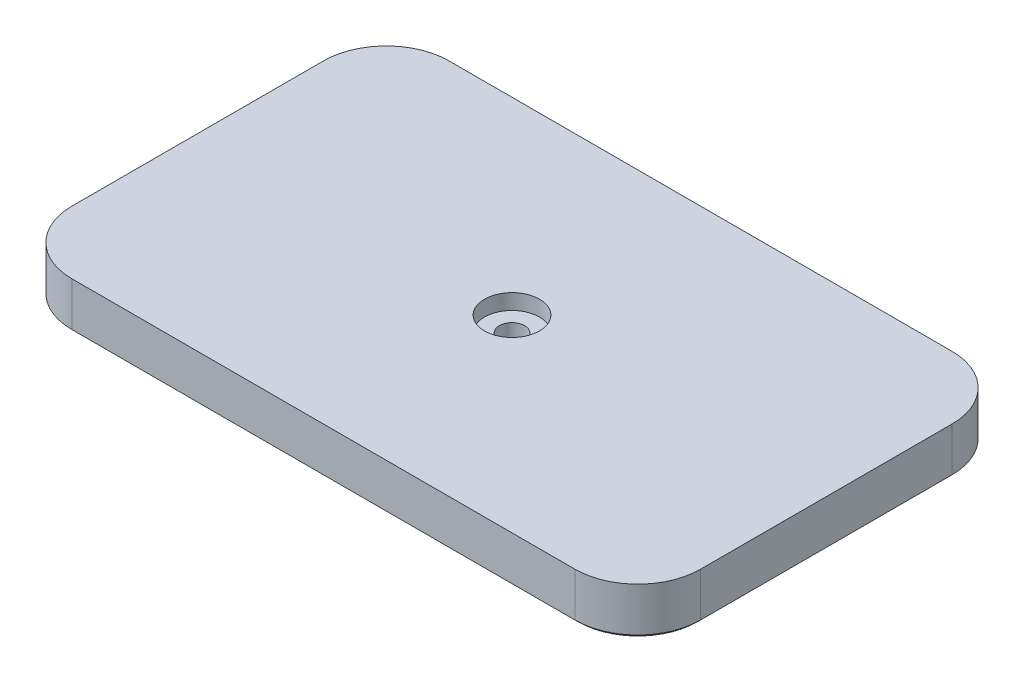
ISO-10303-21;
HEADER;
FILE_DESCRIPTION(('STEP AP214'),'2;1');
FILE_NAME('part.step','',(''),(''),'','','');
FILE_SCHEMA(('AUTOMOTIVE_DESIGN { 1 0 10303 214 1 1 1 1 }'));
ENDSEC;
DATA;
#1=APPLICATION_CONTEXT('core data for automotive mechanical design processes');
#2=APPLICATION_PROTOCOL_DEFINITION('international standard','automotive_design',2000,#1);
#3=PRODUCT_CONTEXT('',#1,'mechanical');
#4=PRODUCT('Part','Part','',(#3));
#5=PRODUCT_RELATED_PRODUCT_CATEGORY('part','',(#4));
#6=PRODUCT_DEFINITION_FORMATION('','',#4);
#7=PRODUCT_DEFINITION_CONTEXT('part definition',#1,'design');
#8=PRODUCT_DEFINITION('design','',#6,#7);
#9=PRODUCT_DEFINITION_SHAPE('','',#8);
#10=(LENGTH_UNIT() NAMED_UNIT(*) SI_UNIT(.MILLI.,.METRE.));
#11=(NAMED_UNIT(*) PLANE_ANGLE_UNIT() SI_UNIT($,.RADIAN.));
#12=(NAMED_UNIT(*) SI_UNIT($,.STERADIAN.) SOLID_ANGLE_UNIT());
#13=UNCERTAINTY_MEASURE_WITH_UNIT(LENGTH_MEASURE(1.E-05),#10,'distance_accuracy_value','');
#14=(GEOMETRIC_REPRESENTATION_CONTEXT(3) GLOBAL_UNCERTAINTY_ASSIGNED_CONTEXT((#13)) GLOBAL_UNIT_ASSIGNED_CONTEXT((#10,
#11,#12)) REPRESENTATION_CONTEXT('',''));
#15=CARTESIAN_POINT('',(0.,0.,0.));
#16=DIRECTION('',(0.,0.,1.));
#17=DIRECTION('',(1.,0.,0.));
#18=AXIS2_PLACEMENT_3D('',#15,#16,#17);
#19=CARTESIAN_POINT('',(-63.5,9.525,-38.1));
#20=DIRECTION('',(1.,0.,0.));
#21=DIRECTION('',(0.,0.,-1.));
#22=AXIS2_PLACEMENT_3D('',#19,#20,#21);
#23=PLANE('',#22);
#24=DIRECTION('',(0.,-1.,0.));
#25=VECTOR('',#24,1.);
#26=CARTESIAN_POINT('',(-63.5,9.525,-25.4));
#27=LINE('',#26,#25);
#28=CARTESIAN_POINT('',(-63.5,9.525,-25.4));
#29=VERTEX_POINT('',#28);
#30=CARTESIAN_POINT('',(-63.5,0.634999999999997,-25.4));
#31=VERTEX_POINT('',#30);
#32=EDGE_CURVE('E134',#29,#31,#27,.T.);
#33=ORIENTED_EDGE('',*,*,#32,.T.);
#34=DIRECTION('',(0.,0.,1.));
#35=VECTOR('',#34,1.);
#36=CARTESIAN_POINT('',(-63.5,0.634999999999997,-38.1));
#37=LINE('',#36,#35);
#38=CARTESIAN_POINT('',(-63.5,0.634999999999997,25.4));
#39=VERTEX_POINT('',#38);
#40=EDGE_CURVE('E11',#31,#39,#37,.T.);
#41=ORIENTED_EDGE('',*,*,#40,.T.);
#42=DIRECTION('',(0.,-1.,0.));
#43=VECTOR('',#42,1.);
#44=CARTESIAN_POINT('',(-63.5,9.525,25.4));
#45=LINE('',#44,#43);
#46=CARTESIAN_POINT('',(-63.5,9.525,25.4));
#47=VERTEX_POINT('',#46);
#48=EDGE_CURVE('E137',#39,#47,#45,.F.);
#49=ORIENTED_EDGE('',*,*,#48,.T.);
#50=DIRECTION('',(0.,0.,1.));
#51=VECTOR('',#50,1.);
#52=CARTESIAN_POINT('',(-63.5,9.525,-38.1));
#53=LINE('',#52,#51);
#54=EDGE_CURVE('E126',#29,#47,#53,.T.);
#55=ORIENTED_EDGE('',*,*,#54,.F.);
#56=EDGE_LOOP('',(#33,#41,#49,#55));
#57=FACE_BOUND('',#56,.T.);
#58=ADVANCED_FACE('F31',(#57),#23,.F.);
#59=CARTESIAN_POINT('',(-63.5,9.525,38.1));
#60=DIRECTION('',(0.,0.,-1.));
#61=DIRECTION('',(-1.,0.,0.));
#62=AXIS2_PLACEMENT_3D('',#59,#60,#61);
#63=PLANE('',#62);
#64=DIRECTION('',(0.,-1.,0.));
#65=VECTOR('',#64,1.);
#66=CARTESIAN_POINT('',(-50.8,9.525,38.1));
#67=LINE('',#66,#65);
#68=CARTESIAN_POINT('',(-50.8,9.525,38.1));
#69=VERTEX_POINT('',#68);
#70=CARTESIAN_POINT('',(-50.8,0.634999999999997,38.1));
#71=VERTEX_POINT('',#70);
#72=EDGE_CURVE('E160',#69,#71,#67,.T.);
#73=ORIENTED_EDGE('',*,*,#72,.T.);
#74=DIRECTION('',(1.,0.,0.));
#75=VECTOR('',#74,1.);
#76=CARTESIAN_POINT('',(-63.5,0.634999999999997,38.1));
#77=LINE('',#76,#75);
#78=CARTESIAN_POINT('',(50.8,0.634999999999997,38.1));
#79=VERTEX_POINT('',#78);
#80=EDGE_CURVE('E183',#71,#79,#77,.T.);
#81=ORIENTED_EDGE('',*,*,#80,.T.);
#82=DIRECTION('',(0.,-1.,0.));
#83=VECTOR('',#82,1.);
#84=CARTESIAN_POINT('',(50.8,9.525,38.1));
#85=LINE('',#84,#83);
#86=CARTESIAN_POINT('',(50.8,9.525,38.1));
#87=VERTEX_POINT('',#86);
#88=EDGE_CURVE('E158',#79,#87,#85,.F.);
#89=ORIENTED_EDGE('',*,*,#88,.T.);
#90=DIRECTION('',(1.,0.,0.));
#91=VECTOR('',#90,1.);
#92=CARTESIAN_POINT('',(-63.5,9.525,38.1));
#93=LINE('',#92,#91);
#94=EDGE_CURVE('E138',#69,#87,#93,.T.);
#95=ORIENTED_EDGE('',*,*,#94,.F.);
#96=EDGE_LOOP('',(#73,#81,#89,#95));
#97=FACE_BOUND('',#96,.T.);
#98=ADVANCED_FACE('F263',(#97),#63,.F.);
#99=CARTESIAN_POINT('',(63.5,9.525,-38.1));
#100=DIRECTION('',(-1.,0.,0.));
#101=DIRECTION('',(0.,0.,1.));
#102=AXIS2_PLACEMENT_3D('',#99,#100,#101);
#103=PLANE('',#102);
#104=DIRECTION('',(0.,-1.,0.));
#105=VECTOR('',#104,1.);
#106=CARTESIAN_POINT('',(63.5,9.525,25.4));
#107=LINE('',#106,#105);
#108=CARTESIAN_POINT('',(63.5,9.525,25.4));
#109=VERTEX_POINT('',#108);
#110=CARTESIAN_POINT('',(63.5,0.634999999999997,25.4));
#111=VERTEX_POINT('',#110);
#112=EDGE_CURVE('E130',#109,#111,#107,.T.);
#113=ORIENTED_EDGE('',*,*,#112,.T.);
#114=DIRECTION('',(0.,0.,-1.));
#115=VECTOR('',#114,1.);
#116=CARTESIAN_POINT('',(63.5,0.634999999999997,-38.1));
#117=LINE('',#116,#115);
#118=CARTESIAN_POINT('',(63.5,0.634999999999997,-25.4));
#119=VERTEX_POINT('',#118);
#120=EDGE_CURVE('E187',#111,#119,#117,.T.);
#121=ORIENTED_EDGE('',*,*,#120,.T.);
#122=DIRECTION('',(0.,-1.,0.));
#123=VECTOR('',#122,1.);
#124=CARTESIAN_POINT('',(63.5,9.525,-25.4));
#125=LINE('',#124,#123);
#126=CARTESIAN_POINT('',(63.5,9.525,-25.4));
#127=VERTEX_POINT('',#126);
#128=EDGE_CURVE('E156',#119,#127,#125,.F.);
#129=ORIENTED_EDGE('',*,*,#128,.T.);
#130=DIRECTION('',(0.,0.,-1.));
#131=VECTOR('',#130,1.);
#132=CARTESIAN_POINT('',(63.5,9.525,-38.1));
#133=LINE('',#132,#131);
#134=EDGE_CURVE('E230',#109,#127,#133,.T.);
#135=ORIENTED_EDGE('',*,*,#134,.F.);
#136=EDGE_LOOP('',(#113,#121,#129,#135));
#137=FACE_BOUND('',#136,.T.);
#138=ADVANCED_FACE('F259',(#137),#103,.F.);
#139=CARTESIAN_POINT('',(-63.5,9.525,-38.1));
#140=DIRECTION('',(0.,0.,1.));
#141=DIRECTION('',(1.,0.,0.));
#142=AXIS2_PLACEMENT_3D('',#139,#140,#141);
#143=PLANE('',#142);
#144=DIRECTION('',(0.,-1.,0.));
#145=VECTOR('',#144,1.);
#146=CARTESIAN_POINT('',(50.8,9.525,-38.1));
#147=LINE('',#146,#145);
#148=CARTESIAN_POINT('',(50.8,9.525,-38.1));
#149=VERTEX_POINT('',#148);
#150=CARTESIAN_POINT('',(50.8,0.634999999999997,-38.1));
#151=VERTEX_POINT('',#150);
#152=EDGE_CURVE('E141',#149,#151,#147,.T.);
#153=ORIENTED_EDGE('',*,*,#152,.T.);
#154=DIRECTION('',(-1.,0.,0.));
#155=VECTOR('',#154,1.);
#156=CARTESIAN_POINT('',(-63.5,0.634999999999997,-38.1));
#157=LINE('',#156,#155);
#158=CARTESIAN_POINT('',(-50.8,0.634999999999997,-38.1));
#159=VERTEX_POINT('',#158);
#160=EDGE_CURVE('E55',#151,#159,#157,.T.);
#161=ORIENTED_EDGE('',*,*,#160,.T.);
#162=DIRECTION('',(0.,-1.,0.));
#163=VECTOR('',#162,1.);
#164=CARTESIAN_POINT('',(-50.8,9.525,-38.1));
#165=LINE('',#164,#163);
#166=CARTESIAN_POINT('',(-50.8,9.525,-38.1));
#167=VERTEX_POINT('',#166);
#168=EDGE_CURVE('E143',#159,#167,#165,.F.);
#169=ORIENTED_EDGE('',*,*,#168,.T.);
#170=DIRECTION('',(-1.,0.,0.));
#171=VECTOR('',#170,1.);
#172=CARTESIAN_POINT('',(-63.5,9.525,-38.1));
#173=LINE('',#172,#171);
#174=EDGE_CURVE('E129',#149,#167,#173,.T.);
#175=ORIENTED_EDGE('',*,*,#174,.F.);
#176=EDGE_LOOP('',(#153,#161,#169,#175));
#177=FACE_BOUND('',#176,.T.);
#178=ADVANCED_FACE('F229',(#177),#143,.F.);
#179=CARTESIAN_POINT('',(-63.5,9.525,38.1));
#180=DIRECTION('',(0.,1.,0.));
#181=DIRECTION('',(0.,0.,1.));
#182=AXIS2_PLACEMENT_3D('',#179,#180,#181);
#183=PLANE('',#182);
#184=CARTESIAN_POINT('',(0.,9.525,0.));
#185=DIRECTION('',(0.,1.,0.));
#186=DIRECTION('',(0.,0.,1.));
#187=AXIS2_PLACEMENT_3D('',#184,#185,#186);
#188=CIRCLE('',#187,5.55625);
#189=CARTESIAN_POINT('',(0.,9.525,5.55625));
#190=VERTEX_POINT('',#189);
#191=EDGE_CURVE('E244',#190,#190,#188,.T.);
#192=ORIENTED_EDGE('',*,*,#191,.F.);
#193=EDGE_LOOP('',(#192));
#194=FACE_BOUND('',#193,.T.);
#195=ORIENTED_EDGE('',*,*,#174,.T.);
#196=CARTESIAN_POINT('',(-50.8,9.525,-25.4));
#197=DIRECTION('',(0.,1.,0.));
#198=DIRECTION('',(0.,0.,1.));
#199=AXIS2_PLACEMENT_3D('',#196,#197,#198);
#200=CIRCLE('',#199,12.7);
#201=EDGE_CURVE('E123',#167,#29,#200,.T.);
#202=ORIENTED_EDGE('',*,*,#201,.T.);
#203=ORIENTED_EDGE('',*,*,#54,.T.);
#204=CARTESIAN_POINT('',(-50.8,9.525,25.4));
#205=DIRECTION('',(0.,1.,0.));
#206=DIRECTION('',(0.,0.,1.));
#207=AXIS2_PLACEMENT_3D('',#204,#205,#206);
#208=CIRCLE('',#207,12.7);
#209=EDGE_CURVE('E151',#47,#69,#208,.T.);
#210=ORIENTED_EDGE('',*,*,#209,.T.);
#211=ORIENTED_EDGE('',*,*,#94,.T.);
#212=CARTESIAN_POINT('',(50.8,9.525,25.4));
#213=DIRECTION('',(0.,1.,0.));
#214=DIRECTION('',(0.,0.,1.));
#215=AXIS2_PLACEMENT_3D('',#212,#213,#214);
#216=CIRCLE('',#215,12.7);
#217=EDGE_CURVE('E149',#87,#109,#216,.T.);
#218=ORIENTED_EDGE('',*,*,#217,.T.);
#219=ORIENTED_EDGE('',*,*,#134,.T.);
#220=CARTESIAN_POINT('',(50.8,9.525,-25.4));
#221=DIRECTION('',(0.,1.,0.));
#222=DIRECTION('',(0.,0.,1.));
#223=AXIS2_PLACEMENT_3D('',#220,#221,#222);
#224=CIRCLE('',#223,12.7);
#225=EDGE_CURVE('E131',#127,#149,#224,.T.);
#226=ORIENTED_EDGE('',*,*,#225,.T.);
#227=EDGE_LOOP('',(#195,#202,#203,#210,#211,#218,#219,#226));
#228=FACE_BOUND('',#227,.T.);
#229=ADVANCED_FACE('F125',(#194,#228),#183,.T.);
#230=CARTESIAN_POINT('',(-63.5,0.,38.1));
#231=DIRECTION('',(0.,1.,0.));
#232=DIRECTION('',(0.,0.,1.));
#233=AXIS2_PLACEMENT_3D('',#230,#231,#232);
#234=PLANE('',#233);
#235=CARTESIAN_POINT('',(0.,0.,0.));
#236=DIRECTION('',(0.,1.,0.));
#237=DIRECTION('',(0.,0.,1.));
#238=AXIS2_PLACEMENT_3D('',#235,#236,#237);
#239=CIRCLE('',#238,2.5527);
#240=CARTESIAN_POINT('',(0.,0.,2.5527));
#241=VERTEX_POINT('',#240);
#242=EDGE_CURVE('E196',#241,#241,#239,.T.);
#243=ORIENTED_EDGE('',*,*,#242,.T.);
#244=EDGE_LOOP('',(#243));
#245=FACE_BOUND('',#244,.T.);
#246=DIRECTION('',(-1.,0.,0.));
#247=VECTOR('',#246,1.);
#248=CARTESIAN_POINT('',(-63.5,0.,37.465));
#249=LINE('',#248,#247);
#250=CARTESIAN_POINT('',(50.8,0.,37.465));
#251=VERTEX_POINT('',#250);
#252=CARTESIAN_POINT('',(-50.8,0.,37.465));
#253=VERTEX_POINT('',#252);
#254=EDGE_CURVE('E175',#251,#253,#249,.T.);
#255=ORIENTED_EDGE('',*,*,#254,.T.);
#256=CARTESIAN_POINT('',(-50.8,0.,25.4));
#257=DIRECTION('',(0.,1.,0.));
#258=DIRECTION('',(0.,0.,1.));
#259=AXIS2_PLACEMENT_3D('',#256,#257,#258);
#260=CIRCLE('',#259,12.065);
#261=CARTESIAN_POINT('',(-62.865,0.,25.4));
#262=VERTEX_POINT('',#261);
#263=EDGE_CURVE('E177',#253,#262,#260,.F.);
#264=ORIENTED_EDGE('',*,*,#263,.T.);
#265=DIRECTION('',(0.,0.,-1.));
#266=VECTOR('',#265,1.);
#267=CARTESIAN_POINT('',(-62.865,0.,38.1));
#268=LINE('',#267,#266);
#269=CARTESIAN_POINT('',(-62.865,0.,-25.4));
#270=VERTEX_POINT('',#269);
#271=EDGE_CURVE('E163',#262,#270,#268,.T.);
#272=ORIENTED_EDGE('',*,*,#271,.T.);
#273=CARTESIAN_POINT('',(-50.8,0.,-25.4));
#274=DIRECTION('',(0.,1.,0.));
#275=DIRECTION('',(0.,0.,1.));
#276=AXIS2_PLACEMENT_3D('',#273,#274,#275);
#277=CIRCLE('',#276,12.065);
#278=CARTESIAN_POINT('',(-50.8,0.,-37.465));
#279=VERTEX_POINT('',#278);
#280=EDGE_CURVE('E165',#270,#279,#277,.F.);
#281=ORIENTED_EDGE('',*,*,#280,.T.);
#282=DIRECTION('',(1.,0.,0.));
#283=VECTOR('',#282,1.);
#284=CARTESIAN_POINT('',(-63.5,0.,-37.465));
#285=LINE('',#284,#283);
#286=CARTESIAN_POINT('',(50.8,0.,-37.465));
#287=VERTEX_POINT('',#286);
#288=EDGE_CURVE('E167',#279,#287,#285,.T.);
#289=ORIENTED_EDGE('',*,*,#288,.T.);
#290=CARTESIAN_POINT('',(50.8,0.,-25.4));
#291=DIRECTION('',(0.,1.,0.));
#292=DIRECTION('',(0.,0.,1.));
#293=AXIS2_PLACEMENT_3D('',#290,#291,#292);
#294=CIRCLE('',#293,12.065);
#295=CARTESIAN_POINT('',(62.865,0.,-25.4));
#296=VERTEX_POINT('',#295);
#297=EDGE_CURVE('E169',#287,#296,#294,.F.);
#298=ORIENTED_EDGE('',*,*,#297,.T.);
#299=DIRECTION('',(0.,0.,1.));
#300=VECTOR('',#299,1.);
#301=CARTESIAN_POINT('',(62.865,0.,38.1));
#302=LINE('',#301,#300);
#303=CARTESIAN_POINT('',(62.865,0.,25.4));
#304=VERTEX_POINT('',#303);
#305=EDGE_CURVE('E171',#296,#304,#302,.T.);
#306=ORIENTED_EDGE('',*,*,#305,.T.);
#307=CARTESIAN_POINT('',(50.8,0.,25.4));
#308=DIRECTION('',(0.,1.,0.));
#309=DIRECTION('',(0.,0.,1.));
#310=AXIS2_PLACEMENT_3D('',#307,#308,#309);
#311=CIRCLE('',#310,12.065);
#312=EDGE_CURVE('E173',#304,#251,#311,.F.);
#313=ORIENTED_EDGE('',*,*,#312,.T.);
#314=EDGE_LOOP('',(#255,#264,#272,#281,#289,#298,#306,#313));
#315=FACE_BOUND('',#314,.T.);
#316=ADVANCED_FACE('F251',(#245,#315),#234,.F.);
#317=CARTESIAN_POINT('',(-50.8,9.525,-25.4));
#318=DIRECTION('',(0.,-1.,0.));
#319=DIRECTION('',(0.,0.,-1.));
#320=AXIS2_PLACEMENT_3D('',#317,#318,#319);
#321=CYLINDRICAL_SURFACE('',#320,12.7);
#322=ORIENTED_EDGE('',*,*,#168,.F.);
#323=CARTESIAN_POINT('',(-50.8,0.634999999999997,-25.4));
#324=DIRECTION('',(0.,1.,0.));
#325=DIRECTION('',(0.,0.,1.));
#326=AXIS2_PLACEMENT_3D('',#323,#324,#325);
#327=CIRCLE('',#326,12.7);
#328=EDGE_CURVE('E40',#159,#31,#327,.T.);
#329=ORIENTED_EDGE('',*,*,#328,.T.);
#330=ORIENTED_EDGE('',*,*,#32,.F.);
#331=ORIENTED_EDGE('',*,*,#201,.F.);
#332=EDGE_LOOP('',(#322,#329,#330,#331));
#333=FACE_BOUND('',#332,.T.);
#334=ADVANCED_FACE('F140',(#333),#321,.T.);
#335=CARTESIAN_POINT('',(50.8,9.525,-25.4));
#336=DIRECTION('',(0.,-1.,0.));
#337=DIRECTION('',(0.,0.,-1.));
#338=AXIS2_PLACEMENT_3D('',#335,#336,#337);
#339=CYLINDRICAL_SURFACE('',#338,12.7);
#340=ORIENTED_EDGE('',*,*,#128,.F.);
#341=CARTESIAN_POINT('',(50.8,0.634999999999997,-25.4));
#342=DIRECTION('',(0.,1.,0.));
#343=DIRECTION('',(0.,0.,1.));
#344=AXIS2_PLACEMENT_3D('',#341,#342,#343);
#345=CIRCLE('',#344,12.7);
#346=EDGE_CURVE('E189',#119,#151,#345,.T.);
#347=ORIENTED_EDGE('',*,*,#346,.T.);
#348=ORIENTED_EDGE('',*,*,#152,.F.);
#349=ORIENTED_EDGE('',*,*,#225,.F.);
#350=EDGE_LOOP('',(#340,#347,#348,#349));
#351=FACE_BOUND('',#350,.T.);
#352=ADVANCED_FACE('F227',(#351),#339,.T.);
#353=CARTESIAN_POINT('',(-50.8,9.525,25.4));
#354=DIRECTION('',(0.,-1.,0.));
#355=DIRECTION('',(0.,0.,-1.));
#356=AXIS2_PLACEMENT_3D('',#353,#354,#355);
#357=CYLINDRICAL_SURFACE('',#356,12.7);
#358=ORIENTED_EDGE('',*,*,#48,.F.);
#359=CARTESIAN_POINT('',(-50.8,0.634999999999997,25.4));
#360=DIRECTION('',(0.,1.,0.));
#361=DIRECTION('',(0.,0.,1.));
#362=AXIS2_PLACEMENT_3D('',#359,#360,#361);
#363=CIRCLE('',#362,12.7);
#364=EDGE_CURVE('E180',#39,#71,#363,.T.);
#365=ORIENTED_EDGE('',*,*,#364,.T.);
#366=ORIENTED_EDGE('',*,*,#72,.F.);
#367=ORIENTED_EDGE('',*,*,#209,.F.);
#368=EDGE_LOOP('',(#358,#365,#366,#367));
#369=FACE_BOUND('',#368,.T.);
#370=ADVANCED_FACE('F276',(#369),#357,.T.);
#371=CARTESIAN_POINT('',(50.8,9.525,25.4));
#372=DIRECTION('',(0.,-1.,0.));
#373=DIRECTION('',(0.,0.,-1.));
#374=AXIS2_PLACEMENT_3D('',#371,#372,#373);
#375=CYLINDRICAL_SURFACE('',#374,12.7);
#376=ORIENTED_EDGE('',*,*,#88,.F.);
#377=CARTESIAN_POINT('',(50.8,0.634999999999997,25.4));
#378=DIRECTION('',(0.,1.,0.));
#379=DIRECTION('',(0.,0.,1.));
#380=AXIS2_PLACEMENT_3D('',#377,#378,#379);
#381=CIRCLE('',#380,12.7);
#382=EDGE_CURVE('E185',#79,#111,#381,.T.);
#383=ORIENTED_EDGE('',*,*,#382,.T.);
#384=ORIENTED_EDGE('',*,*,#112,.F.);
#385=ORIENTED_EDGE('',*,*,#217,.F.);
#386=EDGE_LOOP('',(#376,#383,#384,#385));
#387=FACE_BOUND('',#386,.T.);
#388=ADVANCED_FACE('F279',(#387),#375,.T.);
#389=CARTESIAN_POINT('',(50.8,0.,-25.4));
#390=DIRECTION('',(0.,1.,0.));
#391=DIRECTION('',(0.,0.,1.));
#392=AXIS2_PLACEMENT_3D('',#389,#390,#391);
#393=CONICAL_SURFACE('',#392,12.065,0.785398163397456);
#394=DIRECTION('',(0.,-0.707106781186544,0.707106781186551));
#395=VECTOR('',#394,1.);
#396=CARTESIAN_POINT('',(50.8,0.634999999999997,-38.1));
#397=LINE('',#396,#395);
#398=EDGE_CURVE('E209',#151,#287,#397,.T.);
#399=ORIENTED_EDGE('',*,*,#398,.F.);
#400=ORIENTED_EDGE('',*,*,#346,.F.);
#401=DIRECTION('',(0.707106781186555,0.70710678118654,0.));
#402=VECTOR('',#401,1.);
#403=CARTESIAN_POINT('',(62.865,0.,-25.4));
#404=LINE('',#403,#402);
#405=EDGE_CURVE('E35',#296,#119,#404,.T.);
#406=ORIENTED_EDGE('',*,*,#405,.F.);
#407=ORIENTED_EDGE('',*,*,#297,.F.);
#408=EDGE_LOOP('',(#399,#400,#406,#407));
#409=FACE_BOUND('',#408,.T.);
#410=ADVANCED_FACE('F33',(#409),#393,.T.);
#411=CARTESIAN_POINT('',(63.5,0.634999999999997,-38.1));
#412=DIRECTION('',(-0.70710678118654,0.707106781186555,0.));
#413=DIRECTION('',(-0.707106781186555,-0.70710678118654,0.));
#414=AXIS2_PLACEMENT_3D('',#411,#412,#413);
#415=PLANE('',#414);
#416=ORIENTED_EDGE('',*,*,#405,.T.);
#417=ORIENTED_EDGE('',*,*,#120,.F.);
#418=DIRECTION('',(0.707106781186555,0.70710678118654,0.));
#419=VECTOR('',#418,1.);
#420=CARTESIAN_POINT('',(62.865,0.,25.4));
#421=LINE('',#420,#419);
#422=EDGE_CURVE('E207',#304,#111,#421,.T.);
#423=ORIENTED_EDGE('',*,*,#422,.F.);
#424=ORIENTED_EDGE('',*,*,#305,.F.);
#425=EDGE_LOOP('',(#416,#417,#423,#424));
#426=FACE_BOUND('',#425,.T.);
#427=ADVANCED_FACE('F219',(#426),#415,.F.);
#428=CARTESIAN_POINT('',(-63.5,0.634999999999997,-38.1));
#429=DIRECTION('',(0.,0.707106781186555,0.70710678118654));
#430=DIRECTION('',(0.,-0.70710678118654,0.707106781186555));
#431=AXIS2_PLACEMENT_3D('',#428,#429,#430);
#432=PLANE('',#431);
#433=ORIENTED_EDGE('',*,*,#398,.T.);
#434=ORIENTED_EDGE('',*,*,#288,.F.);
#435=DIRECTION('',(0.,-0.70710678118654,0.707106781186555));
#436=VECTOR('',#435,1.);
#437=CARTESIAN_POINT('',(-50.8,0.634999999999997,-38.1));
#438=LINE('',#437,#436);
#439=EDGE_CURVE('E204',#159,#279,#438,.T.);
#440=ORIENTED_EDGE('',*,*,#439,.F.);
#441=ORIENTED_EDGE('',*,*,#160,.F.);
#442=EDGE_LOOP('',(#433,#434,#440,#441));
#443=FACE_BOUND('',#442,.T.);
#444=ADVANCED_FACE('F304',(#443),#432,.F.);
#445=CARTESIAN_POINT('',(50.8,0.,25.4));
#446=DIRECTION('',(0.,1.,0.));
#447=DIRECTION('',(0.,0.,1.));
#448=AXIS2_PLACEMENT_3D('',#445,#446,#447);
#449=CONICAL_SURFACE('',#448,12.065,0.785398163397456);
#450=ORIENTED_EDGE('',*,*,#422,.T.);
#451=ORIENTED_EDGE('',*,*,#382,.F.);
#452=DIRECTION('',(0.,0.70710678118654,0.707106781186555));
#453=VECTOR('',#452,1.);
#454=CARTESIAN_POINT('',(50.8,0.,37.465));
#455=LINE('',#454,#453);
#456=EDGE_CURVE('E201',#251,#79,#455,.T.);
#457=ORIENTED_EDGE('',*,*,#456,.F.);
#458=ORIENTED_EDGE('',*,*,#312,.F.);
#459=EDGE_LOOP('',(#450,#451,#457,#458));
#460=FACE_BOUND('',#459,.T.);
#461=ADVANCED_FACE('F300',(#460),#449,.T.);
#462=CARTESIAN_POINT('',(-50.8,0.,-25.4));
#463=DIRECTION('',(0.,1.,0.));
#464=DIRECTION('',(0.,0.,1.));
#465=AXIS2_PLACEMENT_3D('',#462,#463,#464);
#466=CONICAL_SURFACE('',#465,12.065,0.785398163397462);
#467=ORIENTED_EDGE('',*,*,#439,.T.);
#468=ORIENTED_EDGE('',*,*,#280,.F.);
#469=DIRECTION('',(0.707106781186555,-0.70710678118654,0.));
#470=VECTOR('',#469,1.);
#471=CARTESIAN_POINT('',(-63.5,0.634999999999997,-25.4));
#472=LINE('',#471,#470);
#473=EDGE_CURVE('E198',#31,#270,#472,.T.);
#474=ORIENTED_EDGE('',*,*,#473,.F.);
#475=ORIENTED_EDGE('',*,*,#328,.F.);
#476=EDGE_LOOP('',(#467,#468,#474,#475));
#477=FACE_BOUND('',#476,.T.);
#478=ADVANCED_FACE('F296',(#477),#466,.T.);
#479=CARTESIAN_POINT('',(-63.5,0.634999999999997,38.1));
#480=DIRECTION('',(0.,0.707106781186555,-0.70710678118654));
#481=DIRECTION('',(0.,0.70710678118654,0.707106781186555));
#482=AXIS2_PLACEMENT_3D('',#479,#480,#481);
#483=PLANE('',#482);
#484=ORIENTED_EDGE('',*,*,#456,.T.);
#485=ORIENTED_EDGE('',*,*,#80,.F.);
#486=DIRECTION('',(0.,0.70710678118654,0.707106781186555));
#487=VECTOR('',#486,1.);
#488=CARTESIAN_POINT('',(-50.8,0.,37.465));
#489=LINE('',#488,#487);
#490=EDGE_CURVE('E195',#253,#71,#489,.T.);
#491=ORIENTED_EDGE('',*,*,#490,.F.);
#492=ORIENTED_EDGE('',*,*,#254,.F.);
#493=EDGE_LOOP('',(#484,#485,#491,#492));
#494=FACE_BOUND('',#493,.T.);
#495=ADVANCED_FACE('F292',(#494),#483,.F.);
#496=CARTESIAN_POINT('',(-63.5,0.634999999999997,-38.1));
#497=DIRECTION('',(0.70710678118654,0.707106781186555,0.));
#498=DIRECTION('',(-0.707106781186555,0.70710678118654,0.));
#499=AXIS2_PLACEMENT_3D('',#496,#497,#498);
#500=PLANE('',#499);
#501=ORIENTED_EDGE('',*,*,#473,.T.);
#502=ORIENTED_EDGE('',*,*,#271,.F.);
#503=DIRECTION('',(0.707106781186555,-0.70710678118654,0.));
#504=VECTOR('',#503,1.);
#505=CARTESIAN_POINT('',(-63.5,0.634999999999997,25.4));
#506=LINE('',#505,#504);
#507=EDGE_CURVE('E193',#39,#262,#506,.T.);
#508=ORIENTED_EDGE('',*,*,#507,.F.);
#509=ORIENTED_EDGE('',*,*,#40,.F.);
#510=EDGE_LOOP('',(#501,#502,#508,#509));
#511=FACE_BOUND('',#510,.T.);
#512=ADVANCED_FACE('F288',(#511),#500,.F.);
#513=CARTESIAN_POINT('',(-50.8,0.,25.4));
#514=DIRECTION('',(0.,1.,0.));
#515=DIRECTION('',(0.,0.,1.));
#516=AXIS2_PLACEMENT_3D('',#513,#514,#515);
#517=CONICAL_SURFACE('',#516,12.065,0.785398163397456);
#518=ORIENTED_EDGE('',*,*,#490,.T.);
#519=ORIENTED_EDGE('',*,*,#364,.F.);
#520=ORIENTED_EDGE('',*,*,#507,.T.);
#521=ORIENTED_EDGE('',*,*,#263,.F.);
#522=EDGE_LOOP('',(#518,#519,#520,#521));
#523=FACE_BOUND('',#522,.T.);
#524=ADVANCED_FACE('F284',(#523),#517,.T.);
#525=CARTESIAN_POINT('',(0.,9.525,0.));
#526=DIRECTION('',(0.,1.,0.));
#527=DIRECTION('',(0.,0.,1.));
#528=AXIS2_PLACEMENT_3D('',#525,#526,#527);
#529=CYLINDRICAL_SURFACE('',#528,2.5527);
#530=ORIENTED_EDGE('',*,*,#242,.F.);
#531=EDGE_LOOP('',(#530));
#532=FACE_BOUND('',#531,.T.);
#533=CARTESIAN_POINT('',(0.,6.4008,0.));
#534=DIRECTION('',(0.,1.,0.));
#535=DIRECTION('',(0.,0.,1.));
#536=AXIS2_PLACEMENT_3D('',#533,#534,#535);
#537=CIRCLE('',#536,2.5527);
#538=CARTESIAN_POINT('',(0.,6.4008,2.5527));
#539=VERTEX_POINT('',#538);
#540=EDGE_CURVE('E238',#539,#539,#537,.T.);
#541=ORIENTED_EDGE('',*,*,#540,.T.);
#542=EDGE_LOOP('',(#541));
#543=FACE_BOUND('',#542,.T.);
#544=ADVANCED_FACE('F287',(#532,#543),#529,.F.);
#545=CARTESIAN_POINT('',(2.55269999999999,6.4008,0.));
#546=DIRECTION('',(0.,-1.,0.));
#547=DIRECTION('',(0.,0.,-1.));
#548=AXIS2_PLACEMENT_3D('',#545,#546,#547);
#549=PLANE('',#548);
#550=ORIENTED_EDGE('',*,*,#540,.F.);
#551=EDGE_LOOP('',(#550));
#552=FACE_BOUND('',#551,.T.);
#553=CARTESIAN_POINT('',(0.,6.4008,0.));
#554=DIRECTION('',(0.,1.,0.));
#555=DIRECTION('',(0.,0.,1.));
#556=AXIS2_PLACEMENT_3D('',#553,#554,#555);
#557=CIRCLE('',#556,5.55625);
#558=CARTESIAN_POINT('',(0.,6.4008,5.55625));
#559=VERTEX_POINT('',#558);
#560=EDGE_CURVE('E241',#559,#559,#557,.T.);
#561=ORIENTED_EDGE('',*,*,#560,.T.);
#562=EDGE_LOOP('',(#561));
#563=FACE_BOUND('',#562,.T.);
#564=ADVANCED_FACE('F346',(#552,#563),#549,.F.);
#565=CARTESIAN_POINT('',(0.,9.525,0.));
#566=DIRECTION('',(0.,1.,0.));
#567=DIRECTION('',(0.,0.,1.));
#568=AXIS2_PLACEMENT_3D('',#565,#566,#567);
#569=CYLINDRICAL_SURFACE('',#568,5.55625);
#570=ORIENTED_EDGE('',*,*,#560,.F.);
#571=EDGE_LOOP('',(#570));
#572=FACE_BOUND('',#571,.T.);
#573=ORIENTED_EDGE('',*,*,#191,.T.);
#574=EDGE_LOOP('',(#573));
#575=FACE_BOUND('',#574,.T.);
#576=ADVANCED_FACE('F248',(#572,#575),#569,.F.);
#577=CLOSED_SHELL('',(#58,#98,#138,#178,#229,#316,#334,#352,#370,#388,#410,#427,#444,#461,#478,
#495,#512,#524,#544,#564,#576));
#578=MANIFOLD_SOLID_BREP('B2',#577);
#579=ADVANCED_BREP_SHAPE_REPRESENTATION('',(#18,#578),#14);
#580=SHAPE_DEFINITION_REPRESENTATION(#9,#579);
ENDSEC;
END-ISO-10303-21;
